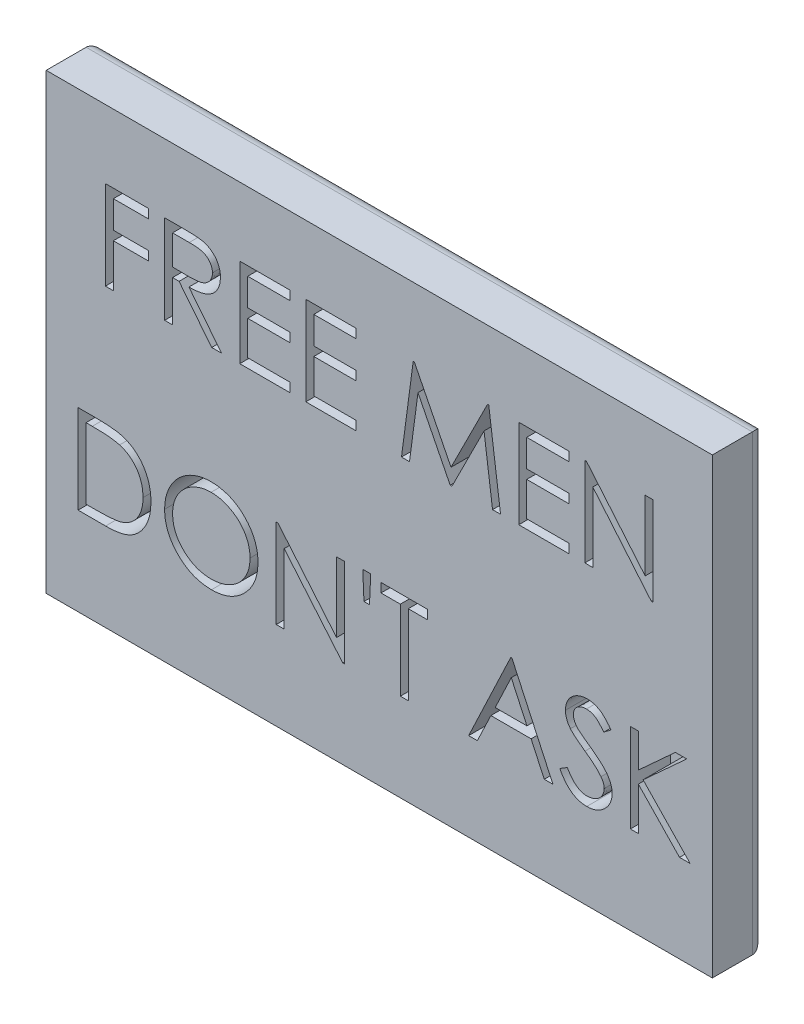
from build123d import *

# Parameters (mm, degrees)
SKETCH1_W           = 31.75
SKETCH1_H           = 21.59
BOSS_EXTRUDE1_DEPTH = 2.54
FILLET1_R           = 0.635
CUT_EXTRUDE1_DEPTH  = 1.905


with BuildPart() as part:
    # Sketch1 → Boss-Extrude1 (new body)
    with BuildSketch(Plane.XY):
        Rectangle(SKETCH1_W, SKETCH1_H)
    extrude(amount=BOSS_EXTRUDE1_DEPTH)

    # Fillet1
    fillet1_edges = [part.edges().sort_by_distance(p)[0] for p in [
        (0, -10.795, 0),
        (-15.875, 0, 0),
        (0, 10.795, 0),
        (15.875, 0, 0),
    ]]
    fillet(fillet1_edges, radius=FILLET1_R)

    # Sketch2 → Cut-Extrude1 (cut)
    # profile 1 of 15: a face of its own
    with BuildSketch(Plane.XY.offset(2.54)):
        Polygon((-13.052777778, 7.532324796), (-10.990384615, 7.532324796), (-10.990384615, 7.098136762), (-12.672863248, 7.098136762), (-12.672863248, 5.795572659), (-10.990384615, 5.795572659), (-10.990384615, 5.361384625), (-12.672863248, 5.361384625), (-12.672863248, 3.298991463), (-13.052777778, 3.298991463), align=None)
    # profile 2 of 15: a face of its own
    with BuildSketch(Plane.XY.offset(2.54)):
        with BuildLine():
            Line((-10.230555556, 7.532324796), (-9.383380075, 7.532324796))
            add(Edge.make_bspline(
                [(-9.383380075, 7.532324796), (-9.326845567, 7.532136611), (-9.218293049, 7.531775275), (-9.062780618, 7.529760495), (-8.921475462, 7.523985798), (-8.794451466, 7.519016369), (-8.68171096, 7.509954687), (-8.582908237, 7.501293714), (-8.498498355, 7.489956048), (-8.447400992, 7.479426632), (-8.424265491, 7.474659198)],
                knots=[0, 0, 0, 0, 1.410062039, 2.707475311, 3.878576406, 4.937260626, 5.877586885, 6.699081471, 7.410979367, 8, 8, 8, 8], degree=3))
            add(Edge.make_bspline(
                [(-8.424265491, 7.474659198), (-8.39329367, 7.467006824), (-8.33201074, 7.451865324), (-8.243775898, 7.419861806), (-8.159696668, 7.382826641), (-8.080122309, 7.339327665), (-8.0054514, 7.289041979), (-7.934914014, 7.232837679), (-7.868190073, 7.171022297), (-7.807978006, 7.102037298), (-7.751204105, 7.029663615), (-7.703320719, 6.95140288), (-7.662043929, 6.869564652), (-7.629180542, 6.783316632), (-7.602718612, 6.693495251), (-7.584060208, 6.599286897), (-7.572870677, 6.501120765), (-7.57173148, 6.434164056), (-7.571153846, 6.400213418)],
                knots=[0, 0, 0, 0, 1.027469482, 2.033020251, 3.019912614, 3.986113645, 4.951240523, 5.91722682, 6.890402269, 7.87763091, 8.8651537, 9.85103654, 10.82876324, 11.815024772, 12.821070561, 13.842952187, 14.906261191, 16, 16, 16, 16], degree=3))
            add(Edge.make_bspline(
                [(-7.571153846, 6.400213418), (-7.572930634, 6.343807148), (-7.576397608, 6.233743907), (-7.608722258, 6.074013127), (-7.661671, 5.925012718), (-7.734633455, 5.786930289), (-7.82754844, 5.662457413), (-7.939217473, 5.553128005), (-8.06970285, 5.46163973), (-8.191174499, 5.398196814), (-8.298476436, 5.357565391), (-8.386811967, 5.328976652), (-8.483171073, 5.306888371), (-8.586630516, 5.287100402), (-8.697620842, 5.272160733), (-8.815876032, 5.261218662), (-8.941480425, 5.254379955), (-9.027766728, 5.25336153), (-9.072155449, 5.252837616)],
                knots=[0, 0, 0, 0, 1.260483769, 2.459530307, 3.627416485, 4.787058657, 5.939039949, 7.08810263, 8.267026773, 9.491475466, 10.141966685, 10.831826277, 11.566392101, 12.351337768, 13.187381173, 14.07005841, 15.007169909, 16, 16, 16, 16], degree=3))
            Line((-9.072155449, 5.252837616), (-7.516880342, 3.298991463))
            Line((-7.516880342, 3.298991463), (-7.986685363, 3.298991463))
            Line((-7.986685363, 3.298991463), (-9.54196047, 5.252837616))
            Line((-9.54196047, 5.252837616), (-9.850641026, 5.252837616))
            Line((-9.850641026, 5.252837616), (-9.850641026, 3.298991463))
            Line((-9.850641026, 3.298991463), (-10.230555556, 3.298991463))
            Line((-10.230555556, 3.298991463), (-10.230555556, 7.532324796))
        make_face()
        with BuildLine():
            Line((-9.850641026, 7.098136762), (-9.850641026, 5.687025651))
            Line((-9.850641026, 5.687025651), (-9.075547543, 5.681089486))
            add(Edge.make_bspline(
                [(-9.075547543, 5.681089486), (-9.039358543, 5.681073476), (-8.969213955, 5.681042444), (-8.867734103, 5.685873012), (-8.773245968, 5.691368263), (-8.686110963, 5.699773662), (-8.606290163, 5.710606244), (-8.533823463, 5.72415652), (-8.468592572, 5.739943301), (-8.392515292, 5.764377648), (-8.307562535, 5.803089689), (-8.215237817, 5.859411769), (-8.136615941, 5.930252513), (-8.070191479, 6.011258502), (-8.016815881, 6.100323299), (-7.979185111, 6.196379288), (-7.955306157, 6.297001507), (-7.952489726, 6.366159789), (-7.951068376, 6.401061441)],
                knots=[0, 0, 0, 0, 1.146690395, 2.22261258, 3.21895312, 4.145990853, 4.996080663, 5.770904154, 6.481378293, 7.121626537, 8.300444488, 9.431385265, 10.535395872, 11.636531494, 12.74115979, 13.810798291, 14.895190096, 16, 16, 16, 16], degree=3))
            add(Edge.make_bspline(
                [(-7.951068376, 6.401061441), (-7.95252237, 6.435105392), (-7.955403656, 6.502568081), (-7.978927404, 6.601332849), (-8.018707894, 6.69454716), (-8.072316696, 6.781831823), (-8.13762996, 6.86106257), (-8.214214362, 6.928852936), (-8.299975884, 6.984792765), (-8.380132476, 7.020539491), (-8.451777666, 7.042455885), (-8.513983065, 7.057878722), (-8.584270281, 7.070269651), (-8.662980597, 7.080197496), (-8.749777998, 7.088730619), (-8.845101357, 7.094478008), (-8.948318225, 7.097881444), (-9.019857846, 7.098049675), (-9.056891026, 7.098136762)],
                knots=[0, 0, 0, 0, 1.101028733, 2.181837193, 3.264309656, 4.369019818, 5.486613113, 6.575447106, 7.666700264, 8.788928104, 9.402425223, 10.0903467, 10.862060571, 11.710948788, 12.657782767, 13.684531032, 14.801375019, 16, 16, 16, 16], degree=3))
            Line((-9.056891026, 7.098136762), (-9.850641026, 7.098136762))
        make_face(mode=Mode.SUBTRACT)
    # profile 3 of 15: a face of its own
    with BuildSketch(Plane.XY.offset(2.54)):
        Polygon((-6.648504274, 7.532324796), (-4.260470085, 7.532324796), (-4.260470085, 7.098136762), (-6.268589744, 7.098136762), (-6.268589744, 5.795572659), (-4.260470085, 5.795572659), (-4.260470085, 5.361384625), (-6.268589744, 5.361384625), (-6.268589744, 3.733179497), (-4.260470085, 3.733179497), (-4.260470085, 3.298991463), (-6.648504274, 3.298991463), align=None)
    # profile 4 of 15: a face of its own
    with BuildSketch(Plane.XY.offset(2.54)):
        Polygon((-3.500641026, 7.532324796), (-1.112606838, 7.532324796), (-1.112606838, 7.098136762), (-3.120726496, 7.098136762), (-3.120726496, 5.795572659), (-1.112606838, 5.795572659), (-1.112606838, 5.361384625), (-3.120726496, 5.361384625), (-3.120726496, 3.733179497), (-1.112606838, 3.733179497), (-1.112606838, 3.298991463), (-3.500641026, 3.298991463), align=None)
    # profile 5 of 15: a face of its own
    with BuildSketch(Plane.XY.offset(2.54)):
        Polygon((1.058333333, 3.298991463), (1.617180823, 7.532324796), (1.671454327, 7.532324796), (3.419230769, 4.058820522), (5.162767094, 7.532324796), (5.217888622, 7.532324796), (5.780128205, 3.298991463), (5.398517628, 3.298991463), (4.993162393, 6.34509189), (3.465024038, 3.298991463), (3.379373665, 3.298991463), (1.845299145, 6.351876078), (1.440791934, 3.298991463), align=None)
    # profile 6 of 15: a face of its own
    with BuildSketch(Plane.XY.offset(2.54)):
        Polygon((6.648504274, 7.532324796), (9.036538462, 7.532324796), (9.036538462, 7.098136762), (7.028418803, 7.098136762), (7.028418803, 5.795572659), (9.036538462, 5.795572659), (9.036538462, 5.361384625), (7.028418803, 5.361384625), (7.028418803, 3.733179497), (9.036538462, 3.733179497), (9.036538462, 3.298991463), (6.648504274, 3.298991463), align=None)
    # profile 7 of 15: a face of its own
    with BuildSketch(Plane.XY.offset(2.54)):
        Polygon((9.796367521, 3.298991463), (9.796367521, 7.532324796), (9.876081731, 7.532324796), (12.672863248, 4.200440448), (12.672863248, 7.532324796), (13.052777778, 7.532324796), (13.052777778, 3.298991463), (12.96627938, 3.298991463), (10.176282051, 6.623243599), (10.176282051, 3.298991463), align=None)
    # profile 8 of 15: a face of its own
    with BuildSketch(Plane.XY.offset(2.54)):
        with BuildLine():
            Line((-14.35534188, -6.597982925), (-14.35534188, -2.364649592))
            Line((-14.35534188, -2.364649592), (-13.500534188, -2.364649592))
            add(Edge.make_bspline(
                [(-13.500534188, -2.364649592), (-13.426185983, -2.365184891), (-13.282545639, -2.366219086), (-13.074976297, -2.372776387), (-12.882923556, -2.384376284), (-12.70701905, -2.401272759), (-12.54677987, -2.422019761), (-12.402654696, -2.448025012), (-12.273898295, -2.478732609), (-12.194711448, -2.504913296), (-12.157264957, -2.517293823)],
                knots=[0, 0, 0, 0, 1.314313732, 2.53924729, 3.670748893, 4.714932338, 5.66265055, 6.526160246, 7.303039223, 8, 8, 8, 8], degree=3))
            add(Edge.make_bspline(
                [(-12.157264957, -2.517293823), (-12.108285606, -2.535957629), (-12.011437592, -2.572862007), (-11.873543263, -2.642477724), (-11.743730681, -2.721354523), (-11.621303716, -2.809596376), (-11.509058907, -2.909701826), (-11.40261126, -3.017418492), (-11.306315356, -3.136663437), (-11.218131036, -3.26496366), (-11.138622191, -3.400807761), (-11.069511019, -3.543936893), (-11.012114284, -3.693624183), (-10.964467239, -3.849453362), (-10.926915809, -4.011767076), (-10.901295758, -4.180754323), (-10.884397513, -4.355747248), (-10.88269928, -4.474491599), (-10.881837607, -4.534741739)],
                knots=[0, 0, 0, 0, 0.984719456, 1.947108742, 2.898477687, 3.838006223, 4.779231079, 5.722358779, 6.681677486, 7.655904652, 8.64651281, 9.637519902, 10.640069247, 11.656948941, 12.698408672, 13.768548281, 14.867775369, 16, 16, 16, 16], degree=3))
            add(Edge.make_bspline(
                [(-10.881837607, -4.534741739), (-10.882598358, -4.587067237), (-10.884097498, -4.690180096), (-10.89755867, -4.842145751), (-10.917124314, -4.989603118), (-10.947415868, -5.131850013), (-10.984188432, -5.270132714), (-11.0313165, -5.402977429), (-11.085304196, -5.531602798), (-11.148259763, -5.65426965), (-11.217373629, -5.770484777), (-11.291543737, -5.880038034), (-11.370690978, -5.98136616), (-11.455570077, -6.074776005), (-11.545084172, -6.160126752), (-11.639819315, -6.23813138), (-11.740019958, -6.307263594), (-11.845237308, -6.370240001), (-11.958540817, -6.425177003), (-12.082076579, -6.471659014), (-12.216371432, -6.510178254), (-12.361095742, -6.542316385), (-12.516499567, -6.567809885), (-12.682735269, -6.584896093), (-12.859547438, -6.596450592), (-12.980958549, -6.59746223), (-13.043449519, -6.597982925)],
                knots=[0, 0, 0, 0, 1.105936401, 2.179363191, 3.223086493, 4.248585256, 5.251745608, 6.245858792, 7.225916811, 8.198733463, 9.158002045, 10.082870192, 10.993790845, 11.873723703, 12.748670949, 13.606408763, 14.465103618, 15.319838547, 16.196477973, 17.123216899, 18.106603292, 19.147568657, 20.255746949, 21.433717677, 22.679120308, 24, 24, 24, 24], degree=3))
            Line((-13.043449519, -6.597982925), (-14.35534188, -6.597982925))
        make_face()
        with BuildLine():
            Line((-13.97542735, -6.163794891), (-13.489509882, -6.163794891))
            add(Edge.make_bspline(
                [(-13.489509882, -6.163794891), (-13.419686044, -6.163494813), (-13.28538923, -6.162917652), (-13.092279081, -6.15785313), (-12.915834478, -6.149577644), (-12.756030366, -6.137996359), (-12.612956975, -6.122673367), (-12.486315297, -6.105588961), (-12.37652046, -6.084304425), (-12.310081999, -6.06501136), (-12.279380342, -6.056095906)],
                knots=[0, 0, 0, 0, 1.375205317, 2.645023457, 3.804390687, 4.853969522, 5.800190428, 6.637939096, 7.370582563, 8, 8, 8, 8], degree=3))
            add(Edge.make_bspline(
                [(-12.279380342, -6.056095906), (-12.240738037, -6.042486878), (-12.164376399, -6.015593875), (-12.054453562, -5.966538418), (-11.951937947, -5.908430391), (-11.855042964, -5.843839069), (-11.765143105, -5.770486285), (-11.681172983, -5.689967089), (-11.603301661, -5.601871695), (-11.532333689, -5.506309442), (-11.468823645, -5.403875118), (-11.41382511, -5.295575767), (-11.365623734, -5.182598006), (-11.327791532, -5.063206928), (-11.298139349, -4.938469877), (-11.277136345, -4.808378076), (-11.264055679, -4.672955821), (-11.262529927, -4.580848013), (-11.261752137, -4.533893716)],
                knots=[0, 0, 0, 0, 0.998632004, 1.973411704, 2.929992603, 3.868527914, 4.809262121, 5.754881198, 6.702106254, 7.672490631, 8.653608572, 9.636854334, 10.631411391, 11.644891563, 12.686317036, 13.754757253, 14.855430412, 16, 16, 16, 16], degree=3))
            add(Edge.make_bspline(
                [(-11.261752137, -4.533893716), (-11.26237297, -4.484383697), (-11.263592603, -4.387120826), (-11.278922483, -4.244408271), (-11.301324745, -4.107150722), (-11.333720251, -3.975339), (-11.375002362, -3.848715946), (-11.426521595, -3.727981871), (-11.48538503, -3.611861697), (-11.555420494, -3.503035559), (-11.632123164, -3.400113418), (-11.717246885, -3.305825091), (-11.809439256, -3.219955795), (-11.90769474, -3.141168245), (-12.01478247, -3.07263218), (-12.128179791, -3.011325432), (-12.249550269, -2.959296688), (-12.333990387, -2.931624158), (-12.376903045, -2.917560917)],
                knots=[0, 0, 0, 0, 1.122418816, 2.205001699, 3.251619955, 4.274784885, 5.280384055, 6.268708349, 7.249350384, 8.229342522, 9.199999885, 10.157847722, 11.105861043, 12.055065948, 13.010012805, 13.98527497, 14.976112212, 16, 16, 16, 16], degree=3))
            add(Edge.make_bspline(
                [(-12.376903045, -2.917560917), (-12.412403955, -2.907743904), (-12.487888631, -2.886870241), (-12.611065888, -2.864100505), (-12.74969564, -2.844016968), (-12.904393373, -2.827013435), (-13.074982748, -2.814812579), (-13.261594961, -2.805654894), (-13.464310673, -2.799478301), (-13.604836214, -2.799056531), (-13.6777711, -2.798837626)],
                knots=[0, 0, 0, 0, 0.674548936, 1.434276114, 2.292660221, 3.240891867, 4.284742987, 5.42552168, 6.663806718, 8, 8, 8, 8], degree=3))
            Line((-13.6777711, -2.798837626), (-13.97542735, -2.798837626))
            Line((-13.97542735, -2.798837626), (-13.97542735, -6.163794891))
        make_face(mode=Mode.SUBTRACT)
    # profile 9 of 15: a face of its own
    with BuildSketch(Plane.XY.offset(2.54)):
        with BuildLine():
            add(Edge.make_bspline(
                [(-8.032478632, -2.256102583), (-7.954091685, -2.258087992), (-7.800133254, -2.261987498), (-7.573861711, -2.291837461), (-7.357846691, -2.343478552), (-7.150328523, -2.412255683), (-6.953789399, -2.504003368), (-6.766749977, -2.614898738), (-6.589655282, -2.746103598), (-6.424892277, -2.89660371), (-6.274116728, -3.060353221), (-6.141279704, -3.235102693), (-6.029952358, -3.41979553), (-5.938529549, -3.613876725), (-5.866806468, -3.816907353), (-5.817313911, -4.029969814), (-5.785699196, -4.25168362), (-5.78200316, -4.40290659), (-5.780128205, -4.479620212)],
                knots=[0, 0, 0, 0, 1.065120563, 2.091984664, 3.0946048, 4.079830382, 5.057816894, 6.036188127, 7.030412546, 8.04752943, 9.064399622, 10.05169764, 11.02544977, 11.989514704, 12.962713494, 13.945757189, 14.957906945, 16, 16, 16, 16], degree=3))
            add(Edge.make_bspline(
                [(-5.780128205, -4.479620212), (-5.782002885, -4.555768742), (-5.785698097, -4.705866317), (-5.817349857, -4.92617315), (-5.866989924, -5.137949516), (-5.937863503, -5.340841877), (-6.02885051, -5.535064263), (-6.140919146, -5.720105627), (-6.272928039, -5.89602663), (-6.423159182, -6.060900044), (-6.586929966, -6.212087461), (-6.762589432, -6.343827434), (-6.946187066, -6.457188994), (-7.140085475, -6.547641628), (-7.341713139, -6.619937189), (-7.552874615, -6.669228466), (-7.772580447, -6.70102327), (-7.922405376, -6.704674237), (-7.998557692, -6.706529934)],
                knots=[0, 0, 0, 0, 1.043624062, 2.057103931, 3.04512605, 4.022047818, 4.998200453, 5.980619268, 6.982898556, 8.009068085, 9.034988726, 10.034168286, 11.015286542, 11.987931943, 12.962482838, 13.94673481, 14.956375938, 16, 16, 16, 16], degree=3))
            add(Edge.make_bspline(
                [(-7.998557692, -6.706529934), (-8.075270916, -6.704655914), (-8.226493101, -6.700961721), (-8.448485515, -6.669294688), (-8.661697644, -6.619775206), (-8.865519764, -6.54900665), (-9.060065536, -6.457545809), (-9.245715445, -6.346022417), (-9.421724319, -6.213691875), (-9.586632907, -6.063509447), (-9.737520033, -5.900016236), (-9.869067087, -5.724835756), (-9.980615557, -5.541404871), (-10.071769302, -5.349214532), (-10.143934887, -5.149193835), (-10.193168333, -4.940008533), (-10.225022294, -4.722851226), (-10.228693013, -4.57499553), (-10.230555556, -4.499972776)],
                knots=[0, 0, 0, 0, 1.053102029, 2.075944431, 3.073151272, 4.055350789, 5.033113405, 6.020478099, 7.024410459, 8.052272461, 9.079885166, 10.07527673, 11.055994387, 12.023226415, 12.992069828, 13.970394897, 14.97016774, 16, 16, 16, 16], degree=3))
            add(Edge.make_bspline(
                [(-10.230555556, -4.499972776), (-10.229908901, -4.449617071), (-10.22862375, -4.349540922), (-10.213151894, -4.200930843), (-10.190701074, -4.054710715), (-10.158525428, -3.91129633), (-10.116444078, -3.771038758), (-10.066790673, -3.632970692), (-10.006145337, -3.498491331), (-9.937588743, -3.36696361), (-9.86107208, -3.240437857), (-9.776555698, -3.120840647), (-9.687008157, -3.007168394), (-9.5888391, -2.90236678), (-9.485283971, -2.803387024), (-9.374662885, -2.711750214), (-9.257650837, -2.626630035), (-9.133744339, -2.549921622), (-9.005996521, -2.480544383), (-8.874307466, -2.421009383), (-8.740465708, -2.369911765), (-8.603844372, -2.328496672), (-8.464806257, -2.295800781), (-8.323047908, -2.273536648), (-8.178682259, -2.25802533), (-8.081422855, -2.256746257), (-8.032478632, -2.256102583)],
                knots=[0, 0, 0, 0, 1.037015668, 2.060948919, 3.074880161, 4.083647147, 5.086022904, 6.090072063, 7.104153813, 8.122640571, 9.144368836, 10.147691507, 11.138137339, 12.123020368, 13.103399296, 14.087645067, 15.080126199, 16.082011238, 17.087798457, 18.072939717, 19.057185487, 20.037253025, 21.01195951, 21.997135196, 22.992090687, 24, 24, 24, 24], degree=3))
        make_face()
        with BuildLine():
            add(Edge.make_bspline(
                [(-8.013822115, -2.690290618), (-8.053996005, -2.690780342), (-8.133959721, -2.691755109), (-8.252837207, -2.70459507), (-8.370151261, -2.722895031), (-8.485926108, -2.748998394), (-8.599677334, -2.784563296), (-8.712465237, -2.82549468), (-8.823261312, -2.875352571), (-8.931699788, -2.931683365), (-9.036825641, -2.994033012), (-9.136021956, -3.062941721), (-9.229545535, -3.136793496), (-9.31716739, -3.21576069), (-9.398630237, -3.300245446), (-9.475537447, -3.388966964), (-9.54480637, -3.484461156), (-9.608288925, -3.584138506), (-9.665097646, -3.68786918), (-9.715613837, -3.794561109), (-9.756936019, -3.905084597), (-9.790636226, -4.018240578), (-9.818575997, -4.133849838), (-9.836276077, -4.252789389), (-9.849257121, -4.374461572), (-9.850176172, -4.456687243), (-9.850641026, -4.498276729)],
                knots=[0, 0, 0, 0, 1.008559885, 2.007477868, 2.99961109, 3.989939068, 4.984837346, 5.991145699, 7.001802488, 8.033829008, 9.059044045, 10.069351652, 11.065060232, 12.050310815, 13.029377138, 14.011219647, 14.996725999, 15.989392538, 16.977580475, 17.965360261, 18.951710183, 19.937753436, 20.929683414, 21.935841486, 22.955955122, 24, 24, 24, 24], degree=3))
            add(Edge.make_bspline(
                [(-9.850641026, -4.498276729), (-9.84909905, -4.559432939), (-9.846065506, -4.679746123), (-9.819507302, -4.856056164), (-9.778598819, -5.025496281), (-9.718295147, -5.187139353), (-9.642880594, -5.342374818), (-9.549714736, -5.489825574), (-9.4393347, -5.629531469), (-9.313951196, -5.760517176), (-9.176884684, -5.880073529), (-9.031339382, -5.985015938), (-8.878874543, -6.073807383), (-8.719092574, -6.146143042), (-8.552846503, -6.203462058), (-8.379065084, -6.242745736), (-8.198905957, -6.268599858), (-8.076102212, -6.271082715), (-8.013822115, -6.2723419)],
                knots=[0, 0, 0, 0, 1.032063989, 2.030389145, 3.003944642, 3.970395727, 4.937377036, 5.913328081, 6.909231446, 7.93887556, 8.970685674, 9.976071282, 10.964166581, 11.944589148, 12.933237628, 13.927779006, 14.949070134, 16, 16, 16, 16], degree=3))
            add(Edge.make_bspline(
                [(-8.013822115, -6.2723419), (-7.971961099, -6.271766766), (-7.888938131, -6.270626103), (-7.765451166, -6.259137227), (-7.644188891, -6.240713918), (-7.525321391, -6.214188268), (-7.408983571, -6.180990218), (-7.294689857, -6.141550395), (-7.183657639, -6.09234551), (-7.074486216, -6.037979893), (-6.969987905, -5.976003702), (-6.870231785, -5.90943375), (-6.777732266, -5.835690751), (-6.690175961, -5.757896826), (-6.608378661, -5.67448341), (-6.532893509, -5.585558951), (-6.463974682, -5.490562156), (-6.400516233, -5.391035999), (-6.343906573, -5.287021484), (-6.294583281, -5.17994273), (-6.252738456, -5.070063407), (-6.218958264, -4.957225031), (-6.192487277, -4.841641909), (-6.174247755, -4.723159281), (-6.161489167, -4.602014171), (-6.160527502, -4.520076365), (-6.160042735, -4.478772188)],
                knots=[0, 0, 0, 0, 1.047197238, 2.076906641, 3.100256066, 4.114471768, 5.12198147, 6.126382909, 7.136867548, 8.15857795, 9.17633901, 10.174870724, 11.156907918, 12.133735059, 13.104061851, 14.077631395, 15.04955518, 16.038496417, 17.029181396, 18.010275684, 18.986308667, 19.968651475, 20.955262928, 21.950658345, 22.966943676, 24, 24, 24, 24], degree=3))
            add(Edge.make_bspline(
                [(-6.160042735, -4.478772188), (-6.160527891, -4.437750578), (-6.161490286, -4.356376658), (-6.174241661, -4.236076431), (-6.192506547, -4.118446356), (-6.21882906, -4.003948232), (-6.252756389, -3.892552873), (-6.294590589, -3.784364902), (-6.34392138, -3.678981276), (-6.400537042, -3.576662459), (-6.464177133, -3.478479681), (-6.533717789, -3.384617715), (-6.610359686, -3.296839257), (-6.691913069, -3.212977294), (-6.780414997, -3.134820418), (-6.875464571, -3.062342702), (-6.975907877, -2.993795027), (-7.082257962, -2.931957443), (-7.192014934, -2.874850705), (-7.304638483, -2.825924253), (-7.418852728, -2.784350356), (-7.534367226, -2.748890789), (-7.652154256, -2.722997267), (-7.771417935, -2.704578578), (-7.891993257, -2.691759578), (-7.973083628, -2.690781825), (-8.013822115, -2.690290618)],
                knots=[0, 0, 0, 0, 1.02996197, 2.043119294, 3.035359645, 4.018872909, 4.991431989, 5.957985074, 6.929999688, 7.912076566, 8.892894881, 9.867085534, 10.843653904, 11.817741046, 12.803660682, 13.806313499, 14.818574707, 15.856120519, 16.894564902, 17.924820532, 18.937903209, 19.946497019, 20.957711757, 21.963978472, 22.977135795, 24, 24, 24, 24], degree=3))
        make_face(mode=Mode.SUBTRACT)
    # profile 10 of 15: a face of its own
    with BuildSketch(Plane.XY.offset(2.54)):
        Polygon((-4.911752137, -6.597982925), (-4.911752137, -2.364649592), (-4.832037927, -2.364649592), (-2.03525641, -5.69653394), (-2.03525641, -2.364649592), (-1.65534188, -2.364649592), (-1.65534188, -6.597982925), (-1.741840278, -6.597982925), (-4.531837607, -3.273730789), (-4.531837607, -6.597982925), align=None)
    # profile 11 of 15: a face of its own
    with BuildSketch(Plane.XY.offset(2.54)):
        Polygon((-0.466412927, -3.558666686), (-0.730148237, -3.558666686), (-0.786965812, -2.256102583), (-0.407051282, -2.256102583), align=None)
    # profile 12 of 15: a face of its own
    with BuildSketch(Plane.XY.offset(2.54)):
        Polygon((0.081410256, -2.798837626), (0.081410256, -2.364649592), (2.306623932, -2.364649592), (2.306623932, -2.798837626), (1.383974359, -2.798837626), (1.383974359, -6.597982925), (1.004059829, -6.597982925), (1.004059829, -2.798837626), align=None)
    # profile 13 of 15: a face of its own
    with BuildSketch(Plane.XY.offset(2.54)):
        Polygon((6.322863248, -2.364649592), (8.276709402, -6.597982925), (7.863721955, -6.597982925), (7.237880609, -5.241145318), (5.318803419, -5.241145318), (4.675153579, -6.597982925), (4.260470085, -6.597982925), (6.268589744, -2.364649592), align=None)
        Polygon((6.291486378, -3.189776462), (5.52487313, -4.806957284), (7.037747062, -4.806957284), align=None, mode=Mode.SUBTRACT)
    # profile 14 of 15: a face of its own
    with BuildSketch(Plane.XY.offset(2.54)):
        with BuildLine():
            Line((8.602350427, -5.781336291), (8.960216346, -5.566786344))
            add(Edge.make_bspline(
                [(8.960216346, -5.566786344), (8.993500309, -5.622502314), (9.057271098, -5.729251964), (9.163650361, -5.873497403), (9.273877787, -5.996097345), (9.388769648, -6.096338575), (9.507624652, -6.175258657), (9.631218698, -6.231141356), (9.759135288, -6.265994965), (9.846189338, -6.270228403), (9.889650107, -6.2723419)],
                knots=[0, 0, 0, 0, 1.272034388, 2.437168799, 3.508375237, 4.49857839, 5.41946034, 6.295179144, 7.148887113, 8, 8, 8, 8], degree=3))
            add(Edge.make_bspline(
                [(9.889650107, -6.2723419), (9.926766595, -6.271308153), (10.000350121, -6.269258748), (10.108677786, -6.24956673), (10.213884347, -6.219313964), (10.313801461, -6.175987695), (10.407050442, -6.123568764), (10.48882235, -6.060254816), (10.559514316, -5.989369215), (10.617340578, -5.910287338), (10.661705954, -5.825237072), (10.695804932, -5.737938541), (10.714728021, -5.647020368), (10.717578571, -5.585805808), (10.719017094, -5.554914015)],
                knots=[0, 0, 0, 0, 1.095163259, 2.171163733, 3.241058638, 4.321873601, 5.38011039, 6.391990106, 7.366004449, 8.327778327, 9.272591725, 10.192022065, 11.087607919, 12, 12, 12, 12], degree=3))
            add(Edge.make_bspline(
                [(10.719017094, -5.554914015), (10.71723388, -5.519667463), (10.713608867, -5.448016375), (10.682969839, -5.342304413), (10.634771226, -5.237689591), (10.590305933, -5.172978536), (10.567220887, -5.139382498)],
                knots=[0, 0, 0, 0, 0.938893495, 1.908633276, 2.914225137, 4, 4, 4, 4], degree=3))
            add(Edge.make_bspline(
                [(10.567220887, -5.139382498), (10.548266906, -5.115135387), (10.508475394, -5.064231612), (10.440067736, -4.988460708), (10.35979634, -4.910303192), (10.270408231, -4.826774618), (10.168647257, -4.741759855), (10.057700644, -4.65120489), (9.934735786, -4.558553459), (9.848497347, -4.496417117), (9.803999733, -4.464355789)],
                knots=[0, 0, 0, 0, 0.722233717, 1.516239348, 2.393582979, 3.351407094, 4.387010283, 5.505090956, 6.712668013, 8, 8, 8, 8], degree=3))
            add(Edge.make_bspline(
                [(9.803999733, -4.464355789), (9.759460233, -4.432631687), (9.6743041, -4.371977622), (9.555216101, -4.281959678), (9.448724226, -4.199658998), (9.355301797, -4.124300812), (9.274989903, -4.055874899), (9.207155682, -3.995038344), (9.153527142, -3.940145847), (9.12370563, -3.904535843), (9.110316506, -3.888547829)],
                knots=[0, 0, 0, 0, 1.452282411, 2.77665338, 3.964542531, 5.026858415, 5.96415736, 6.766646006, 7.446254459, 8, 8, 8, 8], degree=3))
            add(Edge.make_bspline(
                [(9.110316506, -3.888547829), (9.091602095, -3.863630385), (9.054797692, -3.814626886), (9.006215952, -3.738033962), (8.964923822, -3.65962868), (8.932554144, -3.579200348), (8.905296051, -3.497878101), (8.886962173, -3.41460088), (8.875482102, -3.32974236), (8.874306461, -3.272636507), (8.873717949, -3.244049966)],
                knots=[0, 0, 0, 0, 1.068054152, 2.10047183, 3.106115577, 4.101338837, 5.06977816, 6.043150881, 7.020423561, 8, 8, 8, 8], degree=3))
            add(Edge.make_bspline(
                [(8.873717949, -3.244049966), (8.87529663, -3.199261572), (8.87842025, -3.110642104), (8.904836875, -2.981185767), (8.946532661, -2.857588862), (9.004946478, -2.74107503), (9.080248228, -2.634678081), (9.16738955, -2.537174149), (9.271180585, -2.455206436), (9.385060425, -2.383588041), (9.509709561, -2.327531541), (9.64032713, -2.285245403), (9.777120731, -2.261285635), (9.869774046, -2.257847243), (9.916786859, -2.256102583)],
                knots=[0, 0, 0, 0, 1.005424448, 1.989358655, 2.955360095, 3.929531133, 4.905563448, 5.876582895, 6.856512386, 7.866279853, 8.892233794, 9.918561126, 10.94386622, 12, 12, 12, 12], degree=3))
            add(Edge.make_bspline(
                [(9.916786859, -2.256102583), (9.96667258, -2.257823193), (10.065879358, -2.261244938), (10.211807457, -2.290996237), (10.352306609, -2.340224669), (10.465328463, -2.396090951), (10.553784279, -2.451887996), (10.621242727, -2.502711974), (10.68960193, -2.56122282), (10.759413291, -2.627576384), (10.829493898, -2.702381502), (10.900884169, -2.785125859), (10.973751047, -2.875303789), (11.020627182, -2.93968009), (11.04465812, -2.972682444)],
                knots=[0, 0, 0, 0, 1.286793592, 2.559021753, 3.825965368, 5.121522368, 5.803751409, 6.523245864, 7.299691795, 8.125521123, 9.008227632, 9.944561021, 10.946284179, 12, 12, 12, 12], degree=3))
            Line((11.04465812, -2.972682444), (10.7012086, -3.23302566))
            add(Edge.make_bspline(
                [(10.7012086, -3.23302566), (10.680470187, -3.206308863), (10.640532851, -3.154858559), (10.579900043, -3.082805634), (10.522751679, -3.016987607), (10.466447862, -2.959819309), (10.413962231, -2.908170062), (10.363020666, -2.863950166), (10.31435626, -2.82672635), (10.253012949, -2.787001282), (10.175944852, -2.747623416), (10.079201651, -2.71430215), (9.978102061, -2.694278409), (9.909244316, -2.691630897), (9.874385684, -2.690290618)],
                knots=[0, 0, 0, 0, 1.181633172, 2.275549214, 3.290209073, 4.226197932, 5.078386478, 5.862611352, 6.581680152, 7.217281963, 8.414376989, 9.595101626, 10.782541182, 12, 12, 12, 12], degree=3))
            add(Edge.make_bspline(
                [(9.874385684, -2.690290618), (9.830653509, -2.691756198), (9.74632013, -2.69458243), (9.626589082, -2.72544946), (9.518827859, -2.774050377), (9.426235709, -2.842164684), (9.349144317, -2.922865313), (9.293378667, -3.015731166), (9.259814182, -3.118277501), (9.255718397, -3.189810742), (9.253632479, -3.226241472)],
                knots=[0, 0, 0, 0, 1.14458467, 2.207223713, 3.21896685, 4.227309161, 5.202851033, 6.127160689, 7.046193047, 8, 8, 8, 8], degree=3))
            add(Edge.make_bspline(
                [(9.253632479, -3.226241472), (9.254107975, -3.248921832), (9.255059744, -3.294319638), (9.268334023, -3.361389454), (9.285387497, -3.428289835), (9.312411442, -3.494720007), (9.349719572, -3.561841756), (9.398711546, -3.630810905), (9.460413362, -3.702235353), (9.507677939, -3.748689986), (9.532632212, -3.773216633)],
                knots=[0, 0, 0, 0, 0.858281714, 1.717966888, 2.583508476, 3.4729293, 4.427298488, 5.488583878, 6.674047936, 8, 8, 8, 8], degree=3))
            add(Edge.make_bspline(
                [(9.532632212, -3.773216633), (9.541898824, -3.781486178), (9.563914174, -3.801132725), (9.604162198, -3.833296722), (9.657312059, -3.872972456), (9.721975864, -3.922063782), (9.799345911, -3.979009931), (9.889430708, -4.043082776), (9.991226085, -4.116362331), (10.063461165, -4.167594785), (10.101655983, -4.194684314)],
                knots=[0, 0, 0, 0, 0.420754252, 0.999615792, 1.744751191, 2.668019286, 3.750313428, 4.999500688, 6.413464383, 8, 8, 8, 8], degree=3))
            add(Edge.make_bspline(
                [(10.101655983, -4.194684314), (10.147600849, -4.228117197), (10.236566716, -4.29285534), (10.363152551, -4.39012002), (10.477928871, -4.485246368), (10.58129865, -4.577626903), (10.674283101, -4.666560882), (10.75585063, -4.753118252), (10.826832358, -4.836678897), (10.903249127, -4.943809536), (10.981333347, -5.075382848), (11.04839117, -5.236586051), (11.090674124, -5.398415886), (11.09620348, -5.507184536), (11.098931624, -5.56085018)],
                knots=[0, 0, 0, 0, 1.163667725, 2.253281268, 3.268753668, 4.215851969, 5.092017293, 5.902905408, 6.650798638, 7.335211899, 8.59617414, 9.77448103, 10.901945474, 12, 12, 12, 12], degree=3))
            add(Edge.make_bspline(
                [(11.098931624, -5.56085018), (11.0981368, -5.598803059), (11.096562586, -5.673971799), (11.078467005, -5.784346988), (11.051954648, -5.891548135), (11.011995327, -5.994250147), (10.963223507, -6.094331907), (10.901336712, -6.18916813), (10.829602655, -6.280857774), (10.747314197, -6.366955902), (10.657270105, -6.445993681), (10.562100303, -6.516302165), (10.461649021, -6.574925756), (10.35646119, -6.622763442), (10.246512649, -6.660178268), (10.131840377, -6.687287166), (10.01225535, -6.703925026), (9.930974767, -6.705651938), (9.889650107, -6.706529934)],
                knots=[0, 0, 0, 0, 0.983748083, 1.948392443, 2.894712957, 3.844097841, 4.80183111, 5.778335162, 6.776009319, 7.81870978, 8.863265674, 9.881300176, 10.883814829, 11.87499822, 12.874611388, 13.892143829, 14.928324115, 16, 16, 16, 16], degree=3))
            add(Edge.make_bspline(
                [(9.889650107, -6.706529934), (9.85767593, -6.705911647), (9.794130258, -6.704682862), (9.70013879, -6.693819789), (9.608046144, -6.678450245), (9.519007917, -6.654049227), (9.431876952, -6.62444374), (9.347032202, -6.587990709), (9.264432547, -6.544306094), (9.183615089, -6.494358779), (9.104785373, -6.436231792), (9.028682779, -6.368530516), (8.952810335, -6.293122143), (8.879407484, -6.20795889), (8.806989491, -6.114416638), (8.736984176, -6.011620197), (8.66794248, -5.900129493), (8.624622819, -5.821673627), (8.602350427, -5.781336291)],
                knots=[0, 0, 0, 0, 0.915332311, 1.819136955, 2.706846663, 3.586547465, 4.459518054, 5.340707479, 6.227863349, 7.133153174, 8.059268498, 9.028702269, 10.047606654, 11.120612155, 12.245963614, 13.433783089, 14.680604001, 16, 16, 16, 16], degree=3))
        make_face()
    # profile 15 of 15: a face of its own
    with BuildSketch(Plane.XY.offset(2.54)):
        Polygon((11.967307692, -2.364649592), (12.347222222, -2.364649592), (12.347222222, -3.976742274), (14.111959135, -2.364649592), (14.653846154, -2.364649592), (12.573644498, -4.264222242), (14.816666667, -6.597982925), (14.310396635, -6.597982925), (12.347222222, -4.555094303), (12.347222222, -6.597982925), (11.967307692, -6.597982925), align=None)
    extrude(amount=-CUT_EXTRUDE1_DEPTH, mode=Mode.SUBTRACT)


solid = part.part
